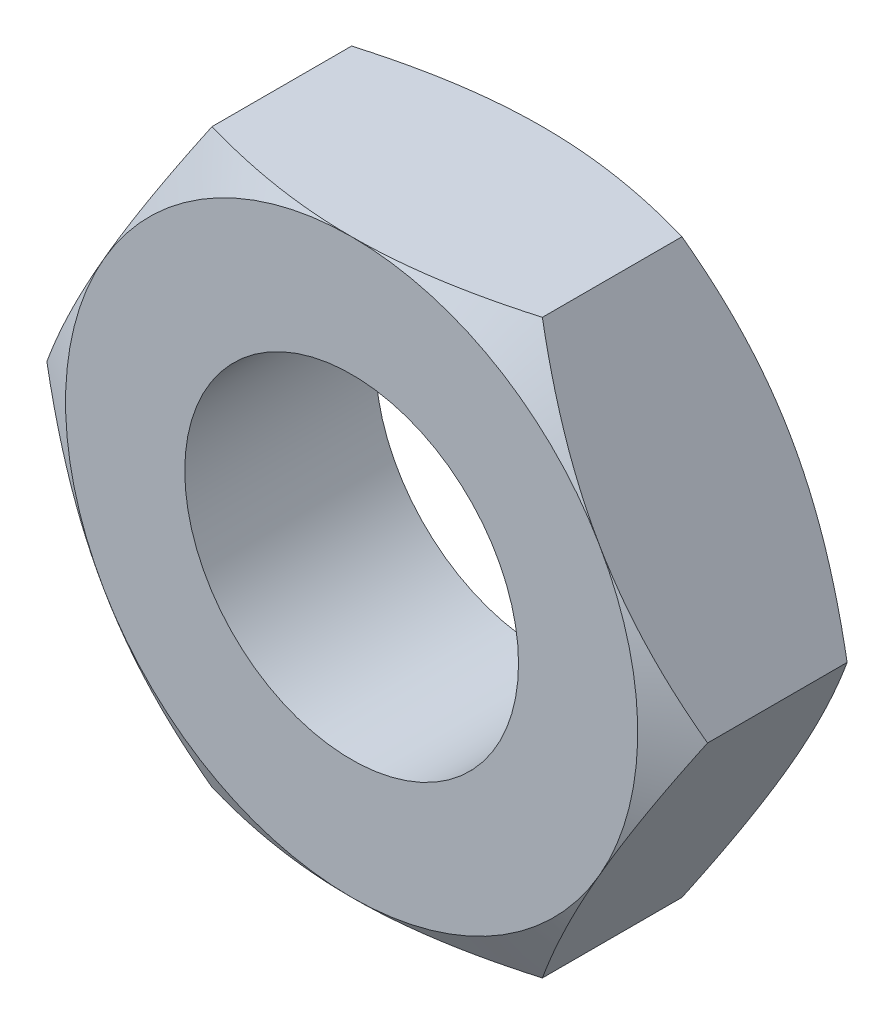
from build123d import *

# Parameters (mm, degrees)
EXTRUDE1_DEPTH = 4
TAPPED_HOLE1_D = 14


with BuildPart() as part:
    # Sketch1 → Extrude1 (new, symmetric)
    with BuildSketch(Plane.XY):
        Polygon((6.92820323, 12), (-6.92820323, 12), (-13.856406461, 0), (-6.92820323, -12), (6.92820323, -12), (13.856406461, 0), align=None)
    extrude(amount=EXTRUDE1_DEPTH, both=True)

    # Sketch2 → Cut-Revolve1 (revolve, cut)
    with BuildSketch(Plane(origin=(0, 0, 0), x_dir=(0, 0, -1), z_dir=(1, 0, 0))):
        Polygon((-4, 12), (-4, 24), (2.92820323, 24), align=None)
    cut_revolve1 = revolve(axis=Axis((0, 0, 0), (0, 0, -1)), mode=Mode.SUBTRACT)

    # Mirror1: Cut-Revolve1 across plane
    add(cut_revolve1.mirror(Plane.XY), mode=Mode.SUBTRACT)

    # Tapped Hole1 (through all)
    with Locations(Plane.XY.offset(4)):
        with Locations((0, 0)):
            Hole(TAPPED_HOLE1_D / 2)


solid = part.part
